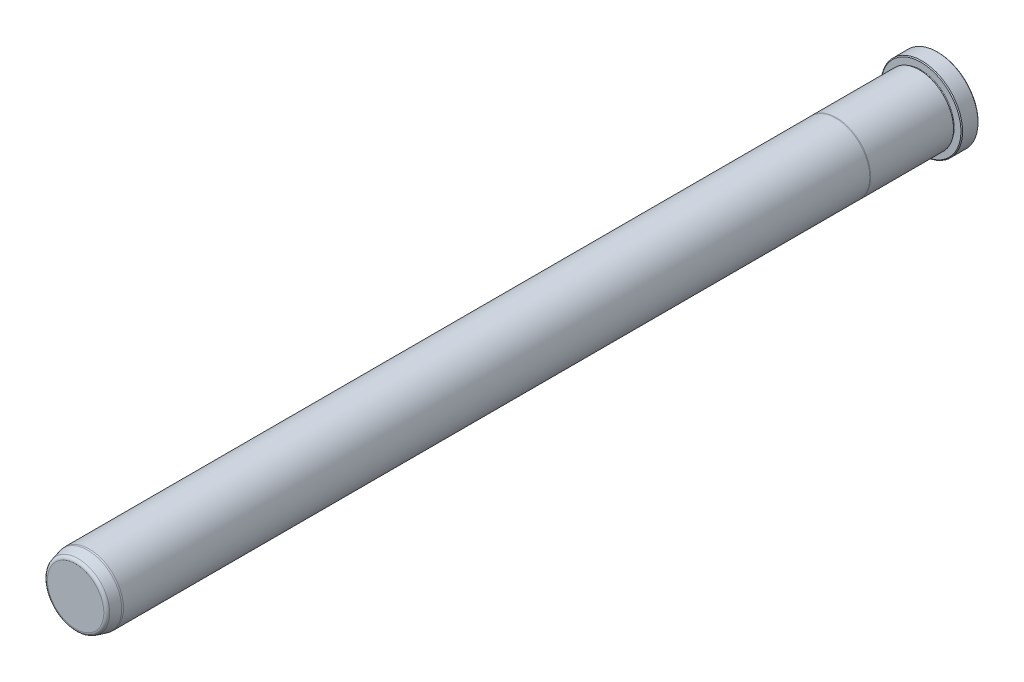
from build123d import *

# Parameters (mm, degrees)
FILLET6_R     = 1.5875
CHAMFER1_SIZE = 0.381


with BuildPart() as part:
    # Sketch1 → Revolve1 (revolve)
    with BuildSketch(Plane(origin=(0, 0, 0), x_dir=(0, 0, -1), z_dir=(1, 0, 0)), mode=Mode.PRIVATE) as revolve1_sk:
        with BuildLine():
            Line((0, 0), (0, 18.923))
            Line((0, 18.923), (-7.9248, 18.923))
            Line((-7.9248, 18.923), (-7.9248, 15.4813))
            ThreePointArc((-7.9248, 15.4813), (-8.3058, 15.1003), (-8.6868, 15.4813))
            Line((-8.6868, 15.4813), (-8.6868, 15.8877))
            Line((-8.6868, 15.8877), (-47.134763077, 15.8877))
            Line((-47.134763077, 15.8877), (-47.498, 15.8623))
            Line((-47.498, 15.8623), (-393.7, 15.8623))
            Line((-393.7, 15.8623), (-394.462, 15.795633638))
            Line((-394.462, 15.795633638), (-400.05, 14.298333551))
            Line((-400.05, 14.298333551), (-400.05, 0))
            Line((-400.05, 0), (0, 0))
        make_face()
    revolve(revolve1_sk.sketch.rotate(Axis((0, 0, 0), (0, 0, -1)), 90), axis=Axis((0, 0, 0), (0, 0, -1)))

    # Fillet6
    fillet6_edges = [part.edges().sort_by_distance(p)[0] for p in [
        (-14.298333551, 0, 400.05),
    ]]
    fillet(fillet6_edges, radius=FILLET6_R)

    # Chamfer1
    chamfer1_edges = [part.edges().sort_by_distance(p)[0] for p in [
        (-18.923, 0, 7.9248),
        (-18.923, 0, 0),
    ]]
    chamfer(chamfer1_edges, length=CHAMFER1_SIZE)


solid = part.part
